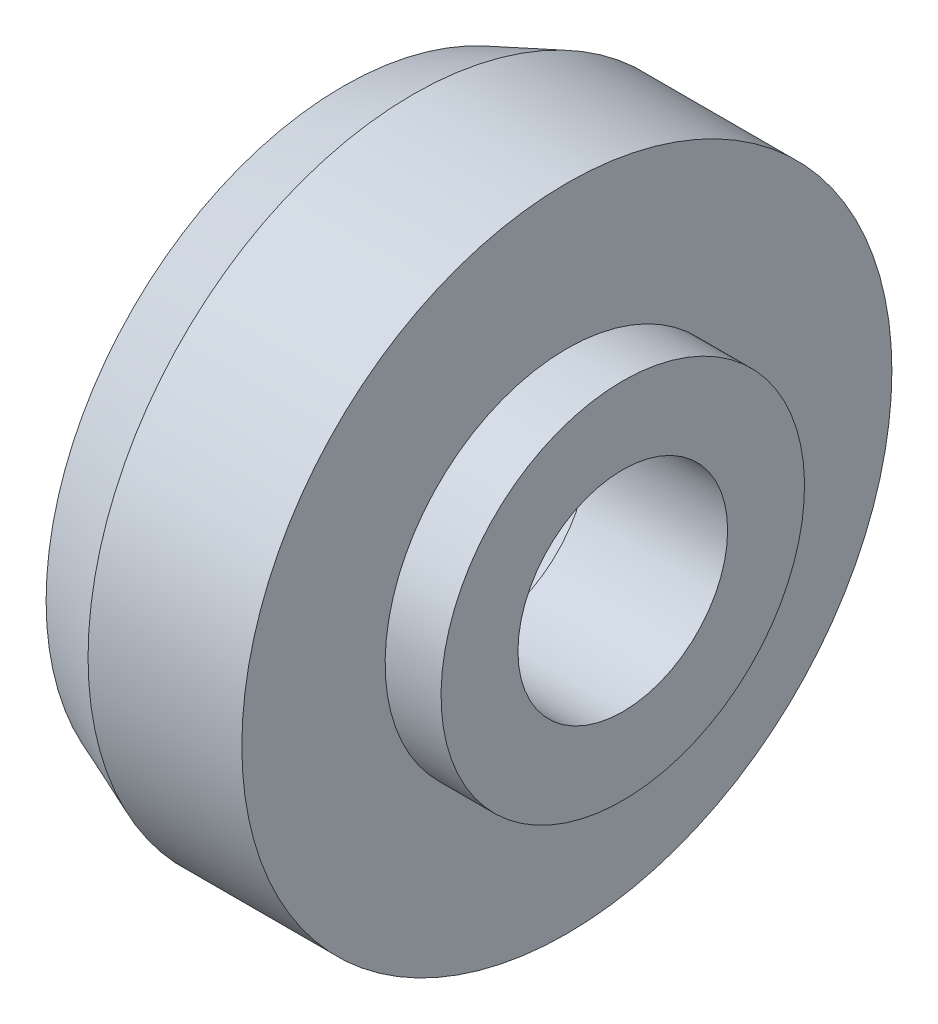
ISO-10303-21;
HEADER;
FILE_DESCRIPTION(('STEP AP214'),'2;1');
FILE_NAME('part.step','',(''),(''),'','','');
FILE_SCHEMA(('AUTOMOTIVE_DESIGN { 1 0 10303 214 1 1 1 1 }'));
ENDSEC;
DATA;
#1=APPLICATION_CONTEXT('core data for automotive mechanical design processes');
#2=APPLICATION_PROTOCOL_DEFINITION('international standard','automotive_design',2000,#1);
#3=PRODUCT_CONTEXT('',#1,'mechanical');
#4=PRODUCT('Part','Part','',(#3));
#5=PRODUCT_RELATED_PRODUCT_CATEGORY('part','',(#4));
#6=PRODUCT_DEFINITION_FORMATION('','',#4);
#7=PRODUCT_DEFINITION_CONTEXT('part definition',#1,'design');
#8=PRODUCT_DEFINITION('design','',#6,#7);
#9=PRODUCT_DEFINITION_SHAPE('','',#8);
#10=(LENGTH_UNIT() NAMED_UNIT(*) SI_UNIT(.MILLI.,.METRE.));
#11=(NAMED_UNIT(*) PLANE_ANGLE_UNIT() SI_UNIT($,.RADIAN.));
#12=(NAMED_UNIT(*) SI_UNIT($,.STERADIAN.) SOLID_ANGLE_UNIT());
#13=UNCERTAINTY_MEASURE_WITH_UNIT(LENGTH_MEASURE(1.E-05),#10,'distance_accuracy_value','');
#14=(GEOMETRIC_REPRESENTATION_CONTEXT(3) GLOBAL_UNCERTAINTY_ASSIGNED_CONTEXT((#13)) GLOBAL_UNIT_ASSIGNED_CONTEXT((#10,
#11,#12)) REPRESENTATION_CONTEXT('',''));
#15=CARTESIAN_POINT('',(0.,0.,0.));
#16=DIRECTION('',(0.,0.,1.));
#17=DIRECTION('',(1.,0.,0.));
#18=AXIS2_PLACEMENT_3D('',#15,#16,#17);
#19=CARTESIAN_POINT('',(-11.8966405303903,-4.97351427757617,0.));
#20=DIRECTION('',(1.,0.,0.));
#21=DIRECTION('',(0.,0.,-1.));
#22=AXIS2_PLACEMENT_3D('',#19,#20,#21);
#23=CYLINDRICAL_SURFACE('',#22,11.);
#24=CARTESIAN_POINT('',(-11.8966405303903,-4.97351427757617,0.));
#25=DIRECTION('',(1.,0.,0.));
#26=DIRECTION('',(0.,0.,-1.));
#27=AXIS2_PLACEMENT_3D('',#24,#25,#26);
#28=CIRCLE('',#27,11.);
#29=CARTESIAN_POINT('',(-11.8966405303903,-4.97351427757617,-11.));
#30=VERTEX_POINT('',#29);
#31=EDGE_CURVE('E19',#30,#30,#28,.T.);
#32=ORIENTED_EDGE('',*,*,#31,.F.);
#33=EDGE_LOOP('',(#32));
#34=FACE_BOUND('',#33,.T.);
#35=CARTESIAN_POINT('',(-9.89664053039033,-4.97351427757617,0.));
#36=DIRECTION('',(1.,0.,0.));
#37=DIRECTION('',(0.,0.,-1.));
#38=AXIS2_PLACEMENT_3D('',#35,#36,#37);
#39=CIRCLE('',#38,11.);
#40=CARTESIAN_POINT('',(-9.89664053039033,-4.97351427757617,-11.));
#41=VERTEX_POINT('',#40);
#42=EDGE_CURVE('E49',#41,#41,#39,.F.);
#43=ORIENTED_EDGE('',*,*,#42,.F.);
#44=EDGE_LOOP('',(#43));
#45=FACE_BOUND('',#44,.T.);
#46=ADVANCED_FACE('F15',(#34,#45),#23,.F.);
#47=CARTESIAN_POINT('',(-11.8966405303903,10.6514857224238,0.));
#48=DIRECTION('',(-1.,0.,0.));
#49=DIRECTION('',(0.,-1.,0.));
#50=AXIS2_PLACEMENT_3D('',#47,#48,#49);
#51=PLANE('',#50);
#52=ORIENTED_EDGE('',*,*,#31,.T.);
#53=EDGE_LOOP('',(#52));
#54=FACE_BOUND('',#53,.T.);
#55=CARTESIAN_POINT('',(-11.8966405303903,-4.97351427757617,0.));
#56=DIRECTION('',(1.,0.,0.));
#57=DIRECTION('',(0.,1.,0.));
#58=AXIS2_PLACEMENT_3D('',#55,#56,#57);
#59=CIRCLE('',#58,20.25);
#60=CARTESIAN_POINT('',(-11.8966405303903,15.2764857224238,0.));
#61=VERTEX_POINT('',#60);
#62=EDGE_CURVE('E47',#61,#61,#59,.T.);
#63=ORIENTED_EDGE('',*,*,#62,.F.);
#64=EDGE_LOOP('',(#63));
#65=FACE_BOUND('',#64,.T.);
#66=ADVANCED_FACE('F56',(#54,#65),#51,.T.);
#67=CARTESIAN_POINT('',(-9.89664053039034,0.526485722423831,0.));
#68=DIRECTION('',(-1.,0.,0.));
#69=DIRECTION('',(0.,-1.,0.));
#70=AXIS2_PLACEMENT_3D('',#67,#68,#69);
#71=PLANE('',#70);
#72=ORIENTED_EDGE('',*,*,#42,.T.);
#73=EDGE_LOOP('',(#72));
#74=FACE_BOUND('',#73,.T.);
#75=CARTESIAN_POINT('',(-9.89664053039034,-4.97351427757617,0.));
#76=DIRECTION('',(1.,0.,0.));
#77=DIRECTION('',(0.,1.,0.));
#78=AXIS2_PLACEMENT_3D('',#75,#76,#77);
#79=CIRCLE('',#78,7.5);
#80=CARTESIAN_POINT('',(-9.89664053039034,2.52648572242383,0.));
#81=VERTEX_POINT('',#80);
#82=EDGE_CURVE('E44',#81,#81,#79,.T.);
#83=ORIENTED_EDGE('',*,*,#82,.T.);
#84=EDGE_LOOP('',(#83));
#85=FACE_BOUND('',#84,.T.);
#86=ADVANCED_FACE('F66',(#74,#85),#71,.T.);
#87=CARTESIAN_POINT('',(-19.8966405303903,-4.97351427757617,0.));
#88=DIRECTION('',(1.,0.,0.));
#89=DIRECTION('',(0.,1.,0.));
#90=AXIS2_PLACEMENT_3D('',#87,#88,#89);
#91=CYLINDRICAL_SURFACE('',#90,20.25);
#92=CARTESIAN_POINT('',(-19.8966405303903,-4.97351427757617,0.));
#93=DIRECTION('',(1.,0.,0.));
#94=DIRECTION('',(0.,1.,0.));
#95=AXIS2_PLACEMENT_3D('',#92,#93,#94);
#96=CIRCLE('',#95,20.25);
#97=CARTESIAN_POINT('',(-19.8966405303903,15.2764857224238,0.));
#98=VERTEX_POINT('',#97);
#99=EDGE_CURVE('E41',#98,#98,#96,.T.);
#100=ORIENTED_EDGE('',*,*,#99,.F.);
#101=EDGE_LOOP('',(#100));
#102=FACE_BOUND('',#101,.T.);
#103=ORIENTED_EDGE('',*,*,#62,.T.);
#104=EDGE_LOOP('',(#103));
#105=FACE_BOUND('',#104,.T.);
#106=ADVANCED_FACE('F99',(#102,#105),#91,.F.);
#107=CARTESIAN_POINT('',(-68.6316388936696,-4.97351427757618,0.));
#108=DIRECTION('',(1.,0.,0.));
#109=DIRECTION('',(0.,1.,0.));
#110=AXIS2_PLACEMENT_3D('',#107,#108,#109);
#111=CYLINDRICAL_SURFACE('',#110,7.5);
#112=CARTESIAN_POINT('',(0.103359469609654,-4.97351427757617,0.));
#113=DIRECTION('',(1.,0.,0.));
#114=DIRECTION('',(0.,1.,0.));
#115=AXIS2_PLACEMENT_3D('',#112,#113,#114);
#116=CIRCLE('',#115,7.5);
#117=CARTESIAN_POINT('',(0.103359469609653,2.52648572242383,0.));
#118=VERTEX_POINT('',#117);
#119=EDGE_CURVE('E38',#118,#118,#116,.F.);
#120=ORIENTED_EDGE('',*,*,#119,.F.);
#121=EDGE_LOOP('',(#120));
#122=FACE_BOUND('',#121,.T.);
#123=ORIENTED_EDGE('',*,*,#82,.F.);
#124=EDGE_LOOP('',(#123));
#125=FACE_BOUND('',#124,.T.);
#126=ADVANCED_FACE('F95',(#122,#125),#111,.F.);
#127=CARTESIAN_POINT('',(-19.8966405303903,15.7764857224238,0.));
#128=DIRECTION('',(-1.,0.,0.));
#129=DIRECTION('',(0.,-1.,0.));
#130=AXIS2_PLACEMENT_3D('',#127,#128,#129);
#131=PLANE('',#130);
#132=ORIENTED_EDGE('',*,*,#99,.T.);
#133=EDGE_LOOP('',(#132));
#134=FACE_BOUND('',#133,.T.);
#135=CARTESIAN_POINT('',(-19.8966405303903,-4.97351427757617,0.));
#136=DIRECTION('',(1.,0.,0.));
#137=DIRECTION('',(0.,1.,0.));
#138=AXIS2_PLACEMENT_3D('',#135,#136,#137);
#139=CIRCLE('',#138,21.25);
#140=CARTESIAN_POINT('',(-19.8966405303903,16.2764857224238,0.));
#141=VERTEX_POINT('',#140);
#142=EDGE_CURVE('E35',#141,#141,#139,.T.);
#143=ORIENTED_EDGE('',*,*,#142,.F.);
#144=EDGE_LOOP('',(#143));
#145=FACE_BOUND('',#144,.T.);
#146=ADVANCED_FACE('F91',(#134,#145),#131,.T.);
#147=CARTESIAN_POINT('',(0.103359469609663,1.52648572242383,0.));
#148=DIRECTION('',(1.,0.,0.));
#149=DIRECTION('',(0.,0.,-1.));
#150=AXIS2_PLACEMENT_3D('',#147,#148,#149);
#151=PLANE('',#150);
#152=CARTESIAN_POINT('',(0.103359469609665,-4.97351427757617,0.));
#153=DIRECTION('',(1.,0.,0.));
#154=DIRECTION('',(0.,1.,0.));
#155=AXIS2_PLACEMENT_3D('',#152,#153,#154);
#156=CIRCLE('',#155,13.);
#157=CARTESIAN_POINT('',(0.103359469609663,8.02648572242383,0.));
#158=VERTEX_POINT('',#157);
#159=EDGE_CURVE('E32',#158,#158,#156,.F.);
#160=ORIENTED_EDGE('',*,*,#159,.F.);
#161=EDGE_LOOP('',(#160));
#162=FACE_BOUND('',#161,.T.);
#163=ORIENTED_EDGE('',*,*,#119,.T.);
#164=EDGE_LOOP('',(#163));
#165=FACE_BOUND('',#164,.T.);
#166=ADVANCED_FACE('F85',(#162,#165),#151,.T.);
#167=CARTESIAN_POINT('',(-14.8966405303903,-4.97351427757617,0.));
#168=DIRECTION('',(1.,0.,0.));
#169=DIRECTION('',(0.,1.,0.));
#170=AXIS2_PLACEMENT_3D('',#167,#168,#169);
#171=CONICAL_SURFACE('',#170,23.25,0.380506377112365);
#172=CARTESIAN_POINT('',(-14.8966405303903,-4.97351427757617,0.));
#173=DIRECTION('',(1.,0.,0.));
#174=DIRECTION('',(0.,1.,0.));
#175=AXIS2_PLACEMENT_3D('',#172,#173,#174);
#176=CIRCLE('',#175,23.25);
#177=CARTESIAN_POINT('',(-14.8966405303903,18.2764857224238,0.));
#178=VERTEX_POINT('',#177);
#179=EDGE_CURVE('E28',#178,#178,#176,.T.);
#180=ORIENTED_EDGE('',*,*,#179,.F.);
#181=EDGE_LOOP('',(#180));
#182=FACE_BOUND('',#181,.T.);
#183=ORIENTED_EDGE('',*,*,#142,.T.);
#184=EDGE_LOOP('',(#183));
#185=FACE_BOUND('',#184,.T.);
#186=ADVANCED_FACE('F79',(#182,#185),#171,.T.);
#187=CARTESIAN_POINT('',(-1.89664053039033,-4.97351427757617,0.));
#188=DIRECTION('',(1.,0.,0.));
#189=DIRECTION('',(0.,1.,0.));
#190=AXIS2_PLACEMENT_3D('',#187,#188,#189);
#191=CYLINDRICAL_SURFACE('',#190,13.);
#192=ORIENTED_EDGE('',*,*,#159,.T.);
#193=EDGE_LOOP('',(#192));
#194=FACE_BOUND('',#193,.T.);
#195=CARTESIAN_POINT('',(-3.89664053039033,-4.97351427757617,0.));
#196=DIRECTION('',(1.,0.,0.));
#197=DIRECTION('',(0.,1.,0.));
#198=AXIS2_PLACEMENT_3D('',#195,#196,#197);
#199=CIRCLE('',#198,13.);
#200=CARTESIAN_POINT('',(-3.89664053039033,8.02648572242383,0.));
#201=VERTEX_POINT('',#200);
#202=EDGE_CURVE('E23',#201,#201,#199,.F.);
#203=ORIENTED_EDGE('',*,*,#202,.F.);
#204=EDGE_LOOP('',(#203));
#205=FACE_BOUND('',#204,.T.);
#206=ADVANCED_FACE('F73',(#194,#205),#191,.T.);
#207=CARTESIAN_POINT('',(-9.39664053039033,-4.97351427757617,0.));
#208=DIRECTION('',(1.,0.,0.));
#209=DIRECTION('',(0.,1.,0.));
#210=AXIS2_PLACEMENT_3D('',#207,#208,#209);
#211=CYLINDRICAL_SURFACE('',#210,23.25);
#212=CARTESIAN_POINT('',(-3.89664053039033,-4.97351427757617,0.));
#213=DIRECTION('',(1.,0.,0.));
#214=DIRECTION('',(0.,1.,0.));
#215=AXIS2_PLACEMENT_3D('',#212,#213,#214);
#216=CIRCLE('',#215,23.25);
#217=CARTESIAN_POINT('',(-3.89664053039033,18.2764857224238,0.));
#218=VERTEX_POINT('',#217);
#219=EDGE_CURVE('E10',#218,#218,#216,.T.);
#220=ORIENTED_EDGE('',*,*,#219,.F.);
#221=EDGE_LOOP('',(#220));
#222=FACE_BOUND('',#221,.T.);
#223=ORIENTED_EDGE('',*,*,#179,.T.);
#224=EDGE_LOOP('',(#223));
#225=FACE_BOUND('',#224,.T.);
#226=ADVANCED_FACE('F69',(#222,#225),#211,.T.);
#227=CARTESIAN_POINT('',(-3.89664053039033,13.1514857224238,0.));
#228=DIRECTION('',(1.,0.,0.));
#229=DIRECTION('',(0.,0.,-1.));
#230=AXIS2_PLACEMENT_3D('',#227,#228,#229);
#231=PLANE('',#230);
#232=ORIENTED_EDGE('',*,*,#219,.T.);
#233=EDGE_LOOP('',(#232));
#234=FACE_BOUND('',#233,.T.);
#235=ORIENTED_EDGE('',*,*,#202,.T.);
#236=EDGE_LOOP('',(#235));
#237=FACE_BOUND('',#236,.T.);
#238=ADVANCED_FACE('F17',(#234,#237),#231,.T.);
#239=CLOSED_SHELL('',(#46,#66,#86,#106,#126,#146,#166,#186,#206,#226,#238));
#240=MANIFOLD_SOLID_BREP('B1',#239);
#241=ADVANCED_BREP_SHAPE_REPRESENTATION('',(#18,#240),#14);
#242=SHAPE_DEFINITION_REPRESENTATION(#9,#241);
ENDSEC;
END-ISO-10303-21;
